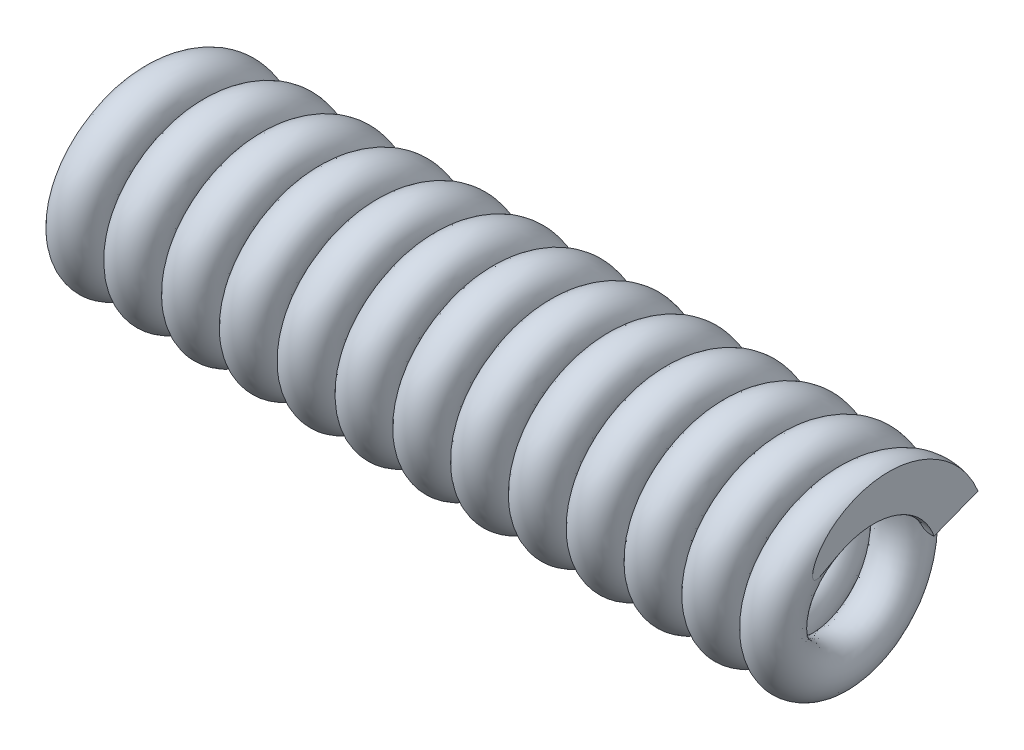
from build123d import *

# Parameters (mm, degrees)
SWEEP1_PITCH       = 0.4318
SWEEP1_HEIGHT      = 5.588
SWEEP1_RADIUS      = 0.5842
SWEEP1_START_ANGLE = -180
SKETCH2_R          = 0.1778
SKETCH3_R          = 0.8255
CUT_EXTRUDE1_DEPTH = 1.27
CUT_EXTRUDE2_START = 5.6134
SKETCH3_2_R        = 0.8255
CUT_EXTRUDE2_DEPTH = 1.27


with BuildPart() as part:
    # Sweep1: sweep along a helix
    with BuildLine() as sweep1_path:
        add(Helix(SWEEP1_PITCH, SWEEP1_HEIGHT, SWEEP1_RADIUS, center=(0, 0, 0), direction=(1, 0, 0), lefthand=True, mode=Mode.PRIVATE).rotate(Axis((0, 0, 0), (1, 0, 0)), SWEEP1_START_ANGLE))
    # Sketch2 → Sweep1 (sweep)
    with BuildSketch(Plane(origin=(0, 0, 0), x_dir=(1, 0, 0), z_dir=(0, 1, 0))):
        with Locations((0, 0.593143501)):
            Circle(SKETCH2_R)
    sweep(path=sweep1_path.line, is_frenet=True)

    # Sketch3 → Cut-Extrude1 (cut)
    with BuildSketch(Plane(origin=(0, 0, 0), x_dir=(0, 0, -1), z_dir=(1, 0, 0))):
        Circle(SKETCH3_R)
    extrude(amount=-CUT_EXTRUDE1_DEPTH, mode=Mode.SUBTRACT)

    # Sketch3_2 → Cut-Extrude2 (cut)
    with BuildSketch(Plane(origin=(0, 0, 0), x_dir=(0, 0, -1), z_dir=(1, 0, 0)).offset(CUT_EXTRUDE2_START)):
        Circle(SKETCH3_2_R)
    extrude(amount=CUT_EXTRUDE2_DEPTH, mode=Mode.SUBTRACT)


solid = part.part
